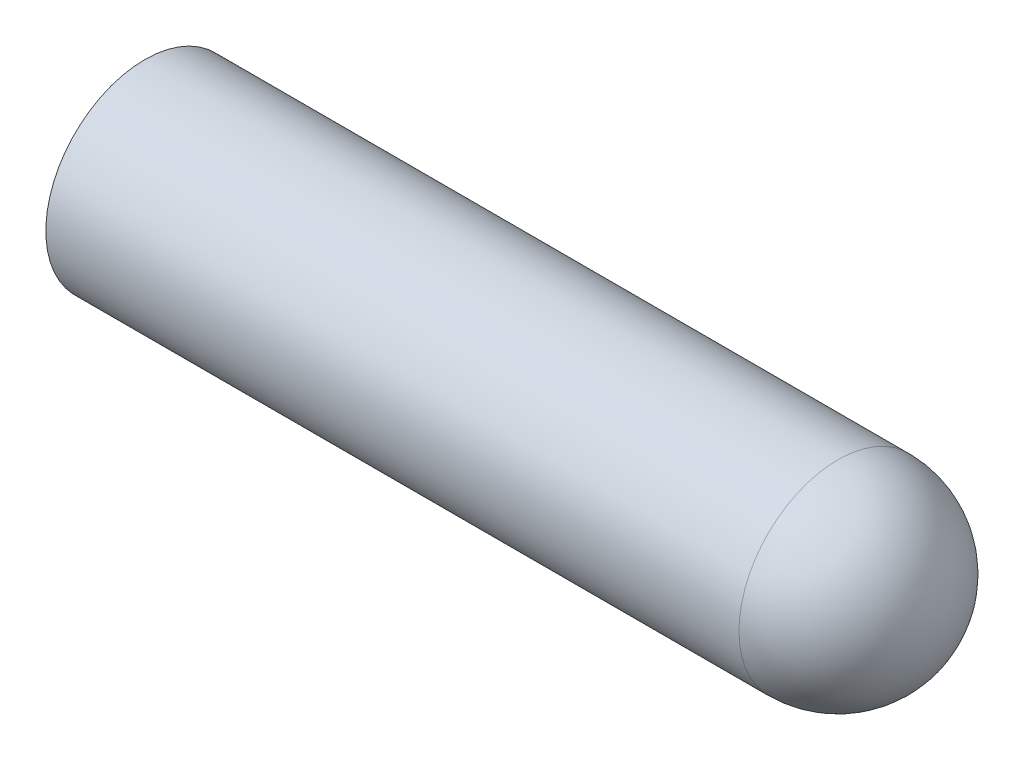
ISO-10303-21;
HEADER;
FILE_DESCRIPTION(('STEP AP214'),'2;1');
FILE_NAME('part.step','',(''),(''),'','','');
FILE_SCHEMA(('AUTOMOTIVE_DESIGN { 1 0 10303 214 1 1 1 1 }'));
ENDSEC;
DATA;
#1=APPLICATION_CONTEXT('core data for automotive mechanical design processes');
#2=APPLICATION_PROTOCOL_DEFINITION('international standard','automotive_design',2000,#1);
#3=PRODUCT_CONTEXT('',#1,'mechanical');
#4=PRODUCT('Part','Part','',(#3));
#5=PRODUCT_RELATED_PRODUCT_CATEGORY('part','',(#4));
#6=PRODUCT_DEFINITION_FORMATION('','',#4);
#7=PRODUCT_DEFINITION_CONTEXT('part definition',#1,'design');
#8=PRODUCT_DEFINITION('design','',#6,#7);
#9=PRODUCT_DEFINITION_SHAPE('','',#8);
#10=(LENGTH_UNIT() NAMED_UNIT(*) SI_UNIT(.MILLI.,.METRE.));
#11=(NAMED_UNIT(*) PLANE_ANGLE_UNIT() SI_UNIT($,.RADIAN.));
#12=(NAMED_UNIT(*) SI_UNIT($,.STERADIAN.) SOLID_ANGLE_UNIT());
#13=UNCERTAINTY_MEASURE_WITH_UNIT(LENGTH_MEASURE(1.E-05),#10,'distance_accuracy_value','');
#14=(GEOMETRIC_REPRESENTATION_CONTEXT(3) GLOBAL_UNCERTAINTY_ASSIGNED_CONTEXT((#13)) GLOBAL_UNIT_ASSIGNED_CONTEXT((#10,
#11,#12)) REPRESENTATION_CONTEXT('',''));
#15=CARTESIAN_POINT('',(0.,0.,0.));
#16=DIRECTION('',(0.,0.,1.));
#17=DIRECTION('',(1.,0.,0.));
#18=AXIS2_PLACEMENT_3D('',#15,#16,#17);
#19=CARTESIAN_POINT('',(-127.36,137.31,0.));
#20=DIRECTION('',(-1.,0.,0.));
#21=DIRECTION('',(0.,-1.,0.));
#22=AXIS2_PLACEMENT_3D('',#19,#20,#21);
#23=CYLINDRICAL_SURFACE('',#22,1.4925);
#24=CARTESIAN_POINT('',(-128.8525,137.31,0.));
#25=DIRECTION('',(-1.,0.,0.));
#26=DIRECTION('',(0.,0.,1.));
#27=AXIS2_PLACEMENT_3D('',#24,#25,#26);
#28=CIRCLE('',#27,1.4925);
#29=CARTESIAN_POINT('',(-128.8525,137.31,1.4925));
#30=VERTEX_POINT('',#29);
#31=EDGE_CURVE('E10',#30,#30,#28,.T.);
#32=ORIENTED_EDGE('',*,*,#31,.T.);
#33=EDGE_LOOP('',(#32));
#34=FACE_BOUND('',#33,.T.);
#35=CARTESIAN_POINT('',(-139.3,137.31,0.));
#36=DIRECTION('',(-1.,0.,0.));
#37=DIRECTION('',(0.,-1.,0.));
#38=AXIS2_PLACEMENT_3D('',#35,#36,#37);
#39=CIRCLE('',#38,1.4925);
#40=CARTESIAN_POINT('',(-139.3,135.8175,0.));
#41=VERTEX_POINT('',#40);
#42=EDGE_CURVE('E21',#41,#41,#39,.T.);
#43=ORIENTED_EDGE('',*,*,#42,.F.);
#44=EDGE_LOOP('',(#43));
#45=FACE_BOUND('',#44,.T.);
#46=ADVANCED_FACE('F14',(#34,#45),#23,.T.);
#47=CARTESIAN_POINT('',(-139.3,137.31,0.));
#48=DIRECTION('',(-1.,0.,0.));
#49=DIRECTION('',(0.,-1.,0.));
#50=AXIS2_PLACEMENT_3D('',#47,#48,#49);
#51=PLANE('',#50);
#52=ORIENTED_EDGE('',*,*,#42,.T.);
#53=EDGE_LOOP('',(#52));
#54=FACE_BOUND('',#53,.T.);
#55=ADVANCED_FACE('F46',(#54),#51,.T.);
#56=CARTESIAN_POINT('',(-128.8525,137.31,0.));
#57=DIRECTION('',(0.,0.,1.));
#58=DIRECTION('',(1.,0.,0.));
#59=AXIS2_PLACEMENT_3D('',#56,#57,#58);
#60=SPHERICAL_SURFACE('',#59,1.4925);
#61=CARTESIAN_POINT('',(-128.8525,137.31,0.));
#62=DIRECTION('',(-1.,0.,0.));
#63=DIRECTION('',(0.,0.,1.));
#64=AXIS2_PLACEMENT_3D('',#61,#62,#63);
#65=SPHERICAL_SURFACE('',#64,1.4925);
#66=ORIENTED_EDGE('',*,*,#31,.F.);
#67=EDGE_LOOP('',(#66));
#68=FACE_BOUND('',#67,.T.);
#69=ADVANCED_FACE('F54',(#68),#65,.T.);
#70=CLOSED_SHELL('',(#46,#55,#69));
#71=MANIFOLD_SOLID_BREP('B1',#70);
#72=ADVANCED_BREP_SHAPE_REPRESENTATION('',(#18,#71),#14);
#73=SHAPE_DEFINITION_REPRESENTATION(#9,#72);
ENDSEC;
END-ISO-10303-21;
